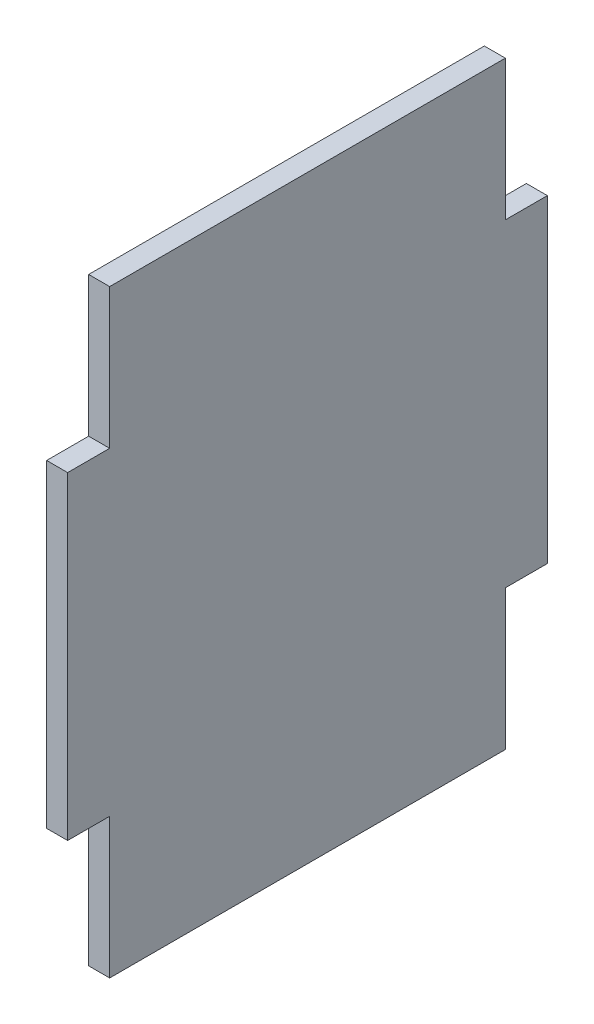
ISO-10303-21;
HEADER;
FILE_DESCRIPTION(('STEP AP214'),'2;1');
FILE_NAME('part.step','',(''),(''),'','','');
FILE_SCHEMA(('AUTOMOTIVE_DESIGN { 1 0 10303 214 1 1 1 1 }'));
ENDSEC;
DATA;
#1=APPLICATION_CONTEXT('core data for automotive mechanical design processes');
#2=APPLICATION_PROTOCOL_DEFINITION('international standard','automotive_design',2000,#1);
#3=PRODUCT_CONTEXT('',#1,'mechanical');
#4=PRODUCT('Part','Part','',(#3));
#5=PRODUCT_RELATED_PRODUCT_CATEGORY('part','',(#4));
#6=PRODUCT_DEFINITION_FORMATION('','',#4);
#7=PRODUCT_DEFINITION_CONTEXT('part definition',#1,'design');
#8=PRODUCT_DEFINITION('design','',#6,#7);
#9=PRODUCT_DEFINITION_SHAPE('','',#8);
#10=(LENGTH_UNIT() NAMED_UNIT(*) SI_UNIT(.MILLI.,.METRE.));
#11=(NAMED_UNIT(*) PLANE_ANGLE_UNIT() SI_UNIT($,.RADIAN.));
#12=(NAMED_UNIT(*) SI_UNIT($,.STERADIAN.) SOLID_ANGLE_UNIT());
#13=UNCERTAINTY_MEASURE_WITH_UNIT(LENGTH_MEASURE(1.E-05),#10,'distance_accuracy_value','');
#14=(GEOMETRIC_REPRESENTATION_CONTEXT(3) GLOBAL_UNCERTAINTY_ASSIGNED_CONTEXT((#13)) GLOBAL_UNIT_ASSIGNED_CONTEXT((#10,
#11,#12)) REPRESENTATION_CONTEXT('',''));
#15=CARTESIAN_POINT('',(0.,0.,0.));
#16=DIRECTION('',(0.,0.,1.));
#17=DIRECTION('',(1.,0.,0.));
#18=AXIS2_PLACEMENT_3D('',#15,#16,#17);
#19=CARTESIAN_POINT('',(6.,0.,0.));
#20=DIRECTION('',(1.,0.,0.));
#21=DIRECTION('',(0.,0.,-1.));
#22=AXIS2_PLACEMENT_3D('',#19,#20,#21);
#23=PLANE('',#22);
#24=DIRECTION('',(0.,1.,0.));
#25=VECTOR('',#24,1.);
#26=CARTESIAN_POINT('',(6.,85.5,-68.5));
#27=LINE('',#26,#25);
#28=CARTESIAN_POINT('',(6.,-45.5,-68.5));
#29=VERTEX_POINT('',#28);
#30=CARTESIAN_POINT('',(6.,45.5,-68.5));
#31=VERTEX_POINT('',#30);
#32=EDGE_CURVE('E204',#29,#31,#27,.T.);
#33=ORIENTED_EDGE('',*,*,#32,.T.);
#34=DIRECTION('',(0.,0.,1.));
#35=VECTOR('',#34,1.);
#36=CARTESIAN_POINT('',(6.,45.5,-68.5));
#37=LINE('',#36,#35);
#38=CARTESIAN_POINT('',(6.,45.5,-56.5));
#39=VERTEX_POINT('',#38);
#40=EDGE_CURVE('E144',#31,#39,#37,.T.);
#41=ORIENTED_EDGE('',*,*,#40,.T.);
#42=DIRECTION('',(0.,1.,0.));
#43=VECTOR('',#42,1.);
#44=CARTESIAN_POINT('',(6.,85.5,-56.5));
#45=LINE('',#44,#43);
#46=CARTESIAN_POINT('',(6.,85.5,-56.5));
#47=VERTEX_POINT('',#46);
#48=EDGE_CURVE('E137',#39,#47,#45,.T.);
#49=ORIENTED_EDGE('',*,*,#48,.T.);
#50=DIRECTION('',(0.,0.,1.));
#51=VECTOR('',#50,1.);
#52=CARTESIAN_POINT('',(6.,85.5,68.5));
#53=LINE('',#52,#51);
#54=CARTESIAN_POINT('',(6.,85.5,56.5));
#55=VERTEX_POINT('',#54);
#56=EDGE_CURVE('E207',#47,#55,#53,.T.);
#57=ORIENTED_EDGE('',*,*,#56,.T.);
#58=DIRECTION('',(0.,1.,0.));
#59=VECTOR('',#58,1.);
#60=CARTESIAN_POINT('',(6.,85.5,56.5));
#61=LINE('',#60,#59);
#62=CARTESIAN_POINT('',(6.,45.5,56.5));
#63=VERTEX_POINT('',#62);
#64=EDGE_CURVE('E190',#63,#55,#61,.T.);
#65=ORIENTED_EDGE('',*,*,#64,.F.);
#66=DIRECTION('',(0.,0.,-1.));
#67=VECTOR('',#66,1.);
#68=CARTESIAN_POINT('',(6.,45.5,68.5));
#69=LINE('',#68,#67);
#70=CARTESIAN_POINT('',(6.,45.5,68.5));
#71=VERTEX_POINT('',#70);
#72=EDGE_CURVE('E182',#71,#63,#69,.T.);
#73=ORIENTED_EDGE('',*,*,#72,.F.);
#74=DIRECTION('',(0.,-1.,0.));
#75=VECTOR('',#74,1.);
#76=CARTESIAN_POINT('',(6.,85.5,68.5));
#77=LINE('',#76,#75);
#78=CARTESIAN_POINT('',(6.,-45.5,68.5));
#79=VERTEX_POINT('',#78);
#80=EDGE_CURVE('E42',#71,#79,#77,.T.);
#81=ORIENTED_EDGE('',*,*,#80,.T.);
#82=DIRECTION('',(0.,0.,-1.));
#83=VECTOR('',#82,1.);
#84=CARTESIAN_POINT('',(6.,-45.5,68.5));
#85=LINE('',#84,#83);
#86=CARTESIAN_POINT('',(6.,-45.5,56.5));
#87=VERTEX_POINT('',#86);
#88=EDGE_CURVE('E171',#79,#87,#85,.T.);
#89=ORIENTED_EDGE('',*,*,#88,.T.);
#90=DIRECTION('',(0.,-1.,0.));
#91=VECTOR('',#90,1.);
#92=CARTESIAN_POINT('',(6.,-85.5,56.5));
#93=LINE('',#92,#91);
#94=CARTESIAN_POINT('',(6.,-85.5,56.5));
#95=VERTEX_POINT('',#94);
#96=EDGE_CURVE('E164',#87,#95,#93,.T.);
#97=ORIENTED_EDGE('',*,*,#96,.T.);
#98=DIRECTION('',(0.,0.,-1.));
#99=VECTOR('',#98,1.);
#100=CARTESIAN_POINT('',(6.,-85.5,68.5));
#101=LINE('',#100,#99);
#102=CARTESIAN_POINT('',(6.,-85.5,-56.5));
#103=VERTEX_POINT('',#102);
#104=EDGE_CURVE('E11',#95,#103,#101,.T.);
#105=ORIENTED_EDGE('',*,*,#104,.T.);
#106=DIRECTION('',(0.,-1.,0.));
#107=VECTOR('',#106,1.);
#108=CARTESIAN_POINT('',(6.,-85.5,-56.5));
#109=LINE('',#108,#107);
#110=CARTESIAN_POINT('',(6.,-45.5,-56.5));
#111=VERTEX_POINT('',#110);
#112=EDGE_CURVE('E154',#111,#103,#109,.T.);
#113=ORIENTED_EDGE('',*,*,#112,.F.);
#114=DIRECTION('',(0.,0.,1.));
#115=VECTOR('',#114,1.);
#116=CARTESIAN_POINT('',(6.,-45.5,-68.5));
#117=LINE('',#116,#115);
#118=EDGE_CURVE('E149',#29,#111,#117,.T.);
#119=ORIENTED_EDGE('',*,*,#118,.F.);
#120=EDGE_LOOP('',(#33,#41,#49,#57,#65,#73,#81,#89,#97,#105,#113,#119));
#121=FACE_BOUND('',#120,.T.);
#122=ADVANCED_FACE('F33',(#121),#23,.T.);
#123=CARTESIAN_POINT('',(0.,0.,0.));
#124=DIRECTION('',(1.,0.,0.));
#125=DIRECTION('',(0.,0.,-1.));
#126=AXIS2_PLACEMENT_3D('',#123,#124,#125);
#127=PLANE('',#126);
#128=DIRECTION('',(0.,0.,1.));
#129=VECTOR('',#128,1.);
#130=CARTESIAN_POINT('',(0.,45.5,-68.5));
#131=LINE('',#130,#129);
#132=CARTESIAN_POINT('',(0.,45.5,-68.5));
#133=VERTEX_POINT('',#132);
#134=CARTESIAN_POINT('',(0.,45.5,-56.5));
#135=VERTEX_POINT('',#134);
#136=EDGE_CURVE('E124',#133,#135,#131,.T.);
#137=ORIENTED_EDGE('',*,*,#136,.F.);
#138=DIRECTION('',(0.,1.,0.));
#139=VECTOR('',#138,1.);
#140=CARTESIAN_POINT('',(0.,85.5,-68.5));
#141=LINE('',#140,#139);
#142=CARTESIAN_POINT('',(0.,-45.5,-68.5));
#143=VERTEX_POINT('',#142);
#144=EDGE_CURVE('E200',#143,#133,#141,.T.);
#145=ORIENTED_EDGE('',*,*,#144,.F.);
#146=DIRECTION('',(0.,0.,1.));
#147=VECTOR('',#146,1.);
#148=CARTESIAN_POINT('',(0.,-45.5,-68.5));
#149=LINE('',#148,#147);
#150=CARTESIAN_POINT('',(0.,-45.5,-56.5));
#151=VERTEX_POINT('',#150);
#152=EDGE_CURVE('E58',#143,#151,#149,.T.);
#153=ORIENTED_EDGE('',*,*,#152,.T.);
#154=DIRECTION('',(0.,-1.,0.));
#155=VECTOR('',#154,1.);
#156=CARTESIAN_POINT('',(0.,-85.5,-56.5));
#157=LINE('',#156,#155);
#158=CARTESIAN_POINT('',(0.,-85.5,-56.5));
#159=VERTEX_POINT('',#158);
#160=EDGE_CURVE('E153',#151,#159,#157,.T.);
#161=ORIENTED_EDGE('',*,*,#160,.T.);
#162=DIRECTION('',(0.,0.,-1.));
#163=VECTOR('',#162,1.);
#164=CARTESIAN_POINT('',(0.,-85.5,68.5));
#165=LINE('',#164,#163);
#166=CARTESIAN_POINT('',(0.,-85.5,56.5));
#167=VERTEX_POINT('',#166);
#168=EDGE_CURVE('E37',#167,#159,#165,.T.);
#169=ORIENTED_EDGE('',*,*,#168,.F.);
#170=DIRECTION('',(0.,-1.,0.));
#171=VECTOR('',#170,1.);
#172=CARTESIAN_POINT('',(0.,-85.5,56.5));
#173=LINE('',#172,#171);
#174=CARTESIAN_POINT('',(0.,-45.5,56.5));
#175=VERTEX_POINT('',#174);
#176=EDGE_CURVE('E168',#175,#167,#173,.T.);
#177=ORIENTED_EDGE('',*,*,#176,.F.);
#178=DIRECTION('',(0.,0.,-1.));
#179=VECTOR('',#178,1.);
#180=CARTESIAN_POINT('',(0.,-45.5,68.5));
#181=LINE('',#180,#179);
#182=CARTESIAN_POINT('',(0.,-45.5,68.5));
#183=VERTEX_POINT('',#182);
#184=EDGE_CURVE('E170',#183,#175,#181,.T.);
#185=ORIENTED_EDGE('',*,*,#184,.F.);
#186=DIRECTION('',(0.,-1.,0.));
#187=VECTOR('',#186,1.);
#188=CARTESIAN_POINT('',(0.,85.5,68.5));
#189=LINE('',#188,#187);
#190=CARTESIAN_POINT('',(0.,45.5,68.5));
#191=VERTEX_POINT('',#190);
#192=EDGE_CURVE('E212',#191,#183,#189,.T.);
#193=ORIENTED_EDGE('',*,*,#192,.F.);
#194=DIRECTION('',(0.,0.,-1.));
#195=VECTOR('',#194,1.);
#196=CARTESIAN_POINT('',(0.,45.5,68.5));
#197=LINE('',#196,#195);
#198=CARTESIAN_POINT('',(0.,45.5,56.5));
#199=VERTEX_POINT('',#198);
#200=EDGE_CURVE('E186',#191,#199,#197,.T.);
#201=ORIENTED_EDGE('',*,*,#200,.T.);
#202=DIRECTION('',(0.,1.,0.));
#203=VECTOR('',#202,1.);
#204=CARTESIAN_POINT('',(0.,85.5,56.5));
#205=LINE('',#204,#203);
#206=CARTESIAN_POINT('',(0.,85.5,56.5));
#207=VERTEX_POINT('',#206);
#208=EDGE_CURVE('E189',#199,#207,#205,.T.);
#209=ORIENTED_EDGE('',*,*,#208,.T.);
#210=DIRECTION('',(0.,0.,1.));
#211=VECTOR('',#210,1.);
#212=CARTESIAN_POINT('',(0.,85.5,68.5));
#213=LINE('',#212,#211);
#214=CARTESIAN_POINT('',(0.,85.5,-56.5));
#215=VERTEX_POINT('',#214);
#216=EDGE_CURVE('E143',#215,#207,#213,.T.);
#217=ORIENTED_EDGE('',*,*,#216,.F.);
#218=DIRECTION('',(0.,1.,0.));
#219=VECTOR('',#218,1.);
#220=CARTESIAN_POINT('',(0.,85.5,-56.5));
#221=LINE('',#220,#219);
#222=EDGE_CURVE('E50',#135,#215,#221,.T.);
#223=ORIENTED_EDGE('',*,*,#222,.F.);
#224=EDGE_LOOP('',(#137,#145,#153,#161,#169,#177,#185,#193,#201,#209,#217,#223));
#225=FACE_BOUND('',#224,.T.);
#226=ADVANCED_FACE('F141',(#225),#127,.F.);
#227=CARTESIAN_POINT('',(6.,85.5,-68.5));
#228=DIRECTION('',(0.,0.,1.));
#229=DIRECTION('',(0.,-1.,0.));
#230=AXIS2_PLACEMENT_3D('',#227,#228,#229);
#231=PLANE('',#230);
#232=DIRECTION('',(1.,0.,0.));
#233=VECTOR('',#232,1.);
#234=CARTESIAN_POINT('',(0.,45.5,-68.5));
#235=LINE('',#234,#233);
#236=EDGE_CURVE('E129',#133,#31,#235,.T.);
#237=ORIENTED_EDGE('',*,*,#236,.T.);
#238=ORIENTED_EDGE('',*,*,#32,.F.);
#239=DIRECTION('',(1.,0.,0.));
#240=VECTOR('',#239,1.);
#241=CARTESIAN_POINT('',(0.,-45.5,-68.5));
#242=LINE('',#241,#240);
#243=EDGE_CURVE('E157',#143,#29,#242,.T.);
#244=ORIENTED_EDGE('',*,*,#243,.F.);
#245=ORIENTED_EDGE('',*,*,#144,.T.);
#246=EDGE_LOOP('',(#237,#238,#244,#245));
#247=FACE_BOUND('',#246,.T.);
#248=ADVANCED_FACE('F35',(#247),#231,.F.);
#249=CARTESIAN_POINT('',(6.,85.5,68.5));
#250=DIRECTION('',(0.,-1.,0.));
#251=DIRECTION('',(0.,0.,-1.));
#252=AXIS2_PLACEMENT_3D('',#249,#250,#251);
#253=PLANE('',#252);
#254=DIRECTION('',(1.,0.,0.));
#255=VECTOR('',#254,1.);
#256=CARTESIAN_POINT('',(0.,85.5,-56.5));
#257=LINE('',#256,#255);
#258=EDGE_CURVE('E133',#215,#47,#257,.T.);
#259=ORIENTED_EDGE('',*,*,#258,.F.);
#260=ORIENTED_EDGE('',*,*,#216,.T.);
#261=DIRECTION('',(1.,0.,0.));
#262=VECTOR('',#261,1.);
#263=CARTESIAN_POINT('',(0.,85.5,56.5));
#264=LINE('',#263,#262);
#265=EDGE_CURVE('E197',#207,#55,#264,.T.);
#266=ORIENTED_EDGE('',*,*,#265,.T.);
#267=ORIENTED_EDGE('',*,*,#56,.F.);
#268=EDGE_LOOP('',(#259,#260,#266,#267));
#269=FACE_BOUND('',#268,.T.);
#270=ADVANCED_FACE('F249',(#269),#253,.F.);
#271=CARTESIAN_POINT('',(6.,85.5,68.5));
#272=DIRECTION('',(0.,0.,-1.));
#273=DIRECTION('',(0.,1.,0.));
#274=AXIS2_PLACEMENT_3D('',#271,#272,#273);
#275=PLANE('',#274);
#276=DIRECTION('',(1.,0.,0.));
#277=VECTOR('',#276,1.);
#278=CARTESIAN_POINT('',(0.,-45.5,68.5));
#279=LINE('',#278,#277);
#280=EDGE_CURVE('E179',#183,#79,#279,.T.);
#281=ORIENTED_EDGE('',*,*,#280,.T.);
#282=ORIENTED_EDGE('',*,*,#80,.F.);
#283=DIRECTION('',(1.,0.,0.));
#284=VECTOR('',#283,1.);
#285=CARTESIAN_POINT('',(0.,45.5,68.5));
#286=LINE('',#285,#284);
#287=EDGE_CURVE('E192',#191,#71,#286,.T.);
#288=ORIENTED_EDGE('',*,*,#287,.F.);
#289=ORIENTED_EDGE('',*,*,#192,.T.);
#290=EDGE_LOOP('',(#281,#282,#288,#289));
#291=FACE_BOUND('',#290,.T.);
#292=ADVANCED_FACE('F242',(#291),#275,.F.);
#293=CARTESIAN_POINT('',(6.,-85.5,68.5));
#294=DIRECTION('',(0.,1.,0.));
#295=DIRECTION('',(0.,0.,1.));
#296=AXIS2_PLACEMENT_3D('',#293,#294,#295);
#297=PLANE('',#296);
#298=ORIENTED_EDGE('',*,*,#168,.T.);
#299=DIRECTION('',(1.,0.,0.));
#300=VECTOR('',#299,1.);
#301=CARTESIAN_POINT('',(0.,-85.5,-56.5));
#302=LINE('',#301,#300);
#303=EDGE_CURVE('E161',#159,#103,#302,.T.);
#304=ORIENTED_EDGE('',*,*,#303,.T.);
#305=ORIENTED_EDGE('',*,*,#104,.F.);
#306=DIRECTION('',(1.,0.,0.));
#307=VECTOR('',#306,1.);
#308=CARTESIAN_POINT('',(0.,-85.5,56.5));
#309=LINE('',#308,#307);
#310=EDGE_CURVE('E174',#167,#95,#309,.T.);
#311=ORIENTED_EDGE('',*,*,#310,.F.);
#312=EDGE_LOOP('',(#298,#304,#305,#311));
#313=FACE_BOUND('',#312,.T.);
#314=ADVANCED_FACE('F221',(#313),#297,.F.);
#315=CARTESIAN_POINT('',(0.,85.5,56.5));
#316=DIRECTION('',(0.,0.,-1.));
#317=DIRECTION('',(0.,1.,0.));
#318=AXIS2_PLACEMENT_3D('',#315,#316,#317);
#319=PLANE('',#318);
#320=ORIENTED_EDGE('',*,*,#64,.T.);
#321=ORIENTED_EDGE('',*,*,#265,.F.);
#322=ORIENTED_EDGE('',*,*,#208,.F.);
#323=DIRECTION('',(1.,0.,0.));
#324=VECTOR('',#323,1.);
#325=CARTESIAN_POINT('',(0.,45.5,56.5));
#326=LINE('',#325,#324);
#327=EDGE_CURVE('E201',#199,#63,#326,.T.);
#328=ORIENTED_EDGE('',*,*,#327,.T.);
#329=EDGE_LOOP('',(#320,#321,#322,#328));
#330=FACE_BOUND('',#329,.T.);
#331=ADVANCED_FACE('F247',(#330),#319,.F.);
#332=CARTESIAN_POINT('',(0.,45.5,68.5));
#333=DIRECTION('',(0.,-1.,0.));
#334=DIRECTION('',(0.,0.,-1.));
#335=AXIS2_PLACEMENT_3D('',#332,#333,#334);
#336=PLANE('',#335);
#337=ORIENTED_EDGE('',*,*,#72,.T.);
#338=ORIENTED_EDGE('',*,*,#327,.F.);
#339=ORIENTED_EDGE('',*,*,#200,.F.);
#340=ORIENTED_EDGE('',*,*,#287,.T.);
#341=EDGE_LOOP('',(#337,#338,#339,#340));
#342=FACE_BOUND('',#341,.T.);
#343=ADVANCED_FACE('F239',(#342),#336,.F.);
#344=CARTESIAN_POINT('',(0.,-45.5,68.5));
#345=DIRECTION('',(0.,-1.,0.));
#346=DIRECTION('',(0.,0.,-1.));
#347=AXIS2_PLACEMENT_3D('',#344,#345,#346);
#348=PLANE('',#347);
#349=ORIENTED_EDGE('',*,*,#88,.F.);
#350=ORIENTED_EDGE('',*,*,#280,.F.);
#351=ORIENTED_EDGE('',*,*,#184,.T.);
#352=DIRECTION('',(1.,0.,0.));
#353=VECTOR('',#352,1.);
#354=CARTESIAN_POINT('',(0.,-45.5,56.5));
#355=LINE('',#354,#353);
#356=EDGE_CURVE('E183',#175,#87,#355,.T.);
#357=ORIENTED_EDGE('',*,*,#356,.T.);
#358=EDGE_LOOP('',(#349,#350,#351,#357));
#359=FACE_BOUND('',#358,.T.);
#360=ADVANCED_FACE('F236',(#359),#348,.T.);
#361=CARTESIAN_POINT('',(0.,-85.5,56.5));
#362=DIRECTION('',(0.,0.,1.));
#363=DIRECTION('',(0.,-1.,0.));
#364=AXIS2_PLACEMENT_3D('',#361,#362,#363);
#365=PLANE('',#364);
#366=ORIENTED_EDGE('',*,*,#96,.F.);
#367=ORIENTED_EDGE('',*,*,#356,.F.);
#368=ORIENTED_EDGE('',*,*,#176,.T.);
#369=ORIENTED_EDGE('',*,*,#310,.T.);
#370=EDGE_LOOP('',(#366,#367,#368,#369));
#371=FACE_BOUND('',#370,.T.);
#372=ADVANCED_FACE('F234',(#371),#365,.T.);
#373=CARTESIAN_POINT('',(0.,-85.5,-56.5));
#374=DIRECTION('',(0.,0.,1.));
#375=DIRECTION('',(0.,-1.,0.));
#376=AXIS2_PLACEMENT_3D('',#373,#374,#375);
#377=PLANE('',#376);
#378=ORIENTED_EDGE('',*,*,#112,.T.);
#379=ORIENTED_EDGE('',*,*,#303,.F.);
#380=ORIENTED_EDGE('',*,*,#160,.F.);
#381=DIRECTION('',(1.,0.,0.));
#382=VECTOR('',#381,1.);
#383=CARTESIAN_POINT('',(0.,-45.5,-56.5));
#384=LINE('',#383,#382);
#385=EDGE_CURVE('E165',#151,#111,#384,.T.);
#386=ORIENTED_EDGE('',*,*,#385,.T.);
#387=EDGE_LOOP('',(#378,#379,#380,#386));
#388=FACE_BOUND('',#387,.T.);
#389=ADVANCED_FACE('F227',(#388),#377,.F.);
#390=CARTESIAN_POINT('',(0.,-45.5,-68.5));
#391=DIRECTION('',(0.,1.,0.));
#392=DIRECTION('',(0.,0.,1.));
#393=AXIS2_PLACEMENT_3D('',#390,#391,#392);
#394=PLANE('',#393);
#395=ORIENTED_EDGE('',*,*,#118,.T.);
#396=ORIENTED_EDGE('',*,*,#385,.F.);
#397=ORIENTED_EDGE('',*,*,#152,.F.);
#398=ORIENTED_EDGE('',*,*,#243,.T.);
#399=EDGE_LOOP('',(#395,#396,#397,#398));
#400=FACE_BOUND('',#399,.T.);
#401=ADVANCED_FACE('F251',(#400),#394,.F.);
#402=CARTESIAN_POINT('',(0.,45.5,-68.5));
#403=DIRECTION('',(0.,1.,0.));
#404=DIRECTION('',(0.,0.,1.));
#405=AXIS2_PLACEMENT_3D('',#402,#403,#404);
#406=PLANE('',#405);
#407=ORIENTED_EDGE('',*,*,#40,.F.);
#408=ORIENTED_EDGE('',*,*,#236,.F.);
#409=ORIENTED_EDGE('',*,*,#136,.T.);
#410=DIRECTION('',(1.,0.,0.));
#411=VECTOR('',#410,1.);
#412=CARTESIAN_POINT('',(0.,45.5,-56.5));
#413=LINE('',#412,#411);
#414=EDGE_CURVE('E126',#135,#39,#413,.T.);
#415=ORIENTED_EDGE('',*,*,#414,.T.);
#416=EDGE_LOOP('',(#407,#408,#409,#415));
#417=FACE_BOUND('',#416,.T.);
#418=ADVANCED_FACE('F125',(#417),#406,.T.);
#419=CARTESIAN_POINT('',(0.,85.5,-56.5));
#420=DIRECTION('',(0.,0.,-1.));
#421=DIRECTION('',(0.,1.,0.));
#422=AXIS2_PLACEMENT_3D('',#419,#420,#421);
#423=PLANE('',#422);
#424=ORIENTED_EDGE('',*,*,#48,.F.);
#425=ORIENTED_EDGE('',*,*,#414,.F.);
#426=ORIENTED_EDGE('',*,*,#222,.T.);
#427=ORIENTED_EDGE('',*,*,#258,.T.);
#428=EDGE_LOOP('',(#424,#425,#426,#427));
#429=FACE_BOUND('',#428,.T.);
#430=ADVANCED_FACE('F135',(#429),#423,.T.);
#431=CLOSED_SHELL('',(#122,#226,#248,#270,#292,#314,#331,#343,#360,#372,#389,#401,#418,#430));
#432=MANIFOLD_SOLID_BREP('B2',#431);
#433=ADVANCED_BREP_SHAPE_REPRESENTATION('',(#18,#432),#14);
#434=SHAPE_DEFINITION_REPRESENTATION(#9,#433);
ENDSEC;
END-ISO-10303-21;
